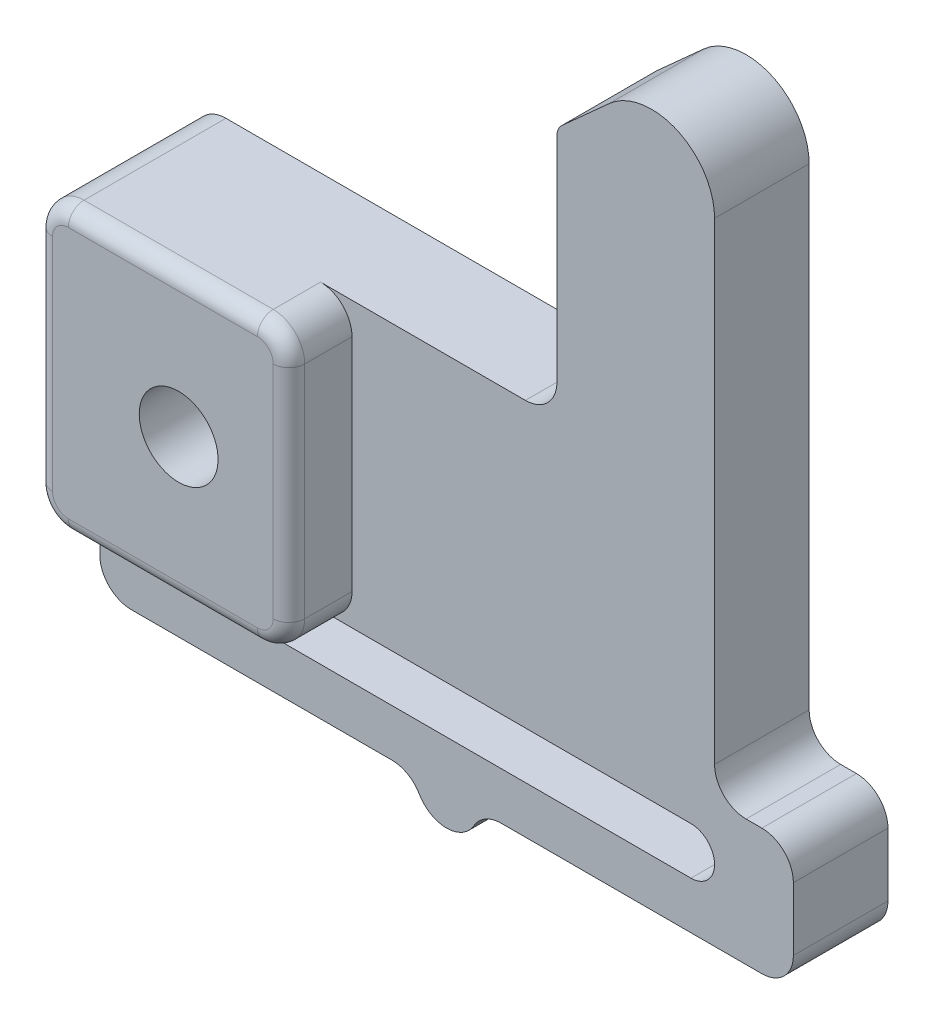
ISO-10303-21;
HEADER;
FILE_DESCRIPTION(('STEP AP214'),'2;1');
FILE_NAME('part.step','',(''),(''),'','','');
FILE_SCHEMA(('AUTOMOTIVE_DESIGN { 1 0 10303 214 1 1 1 1 }'));
ENDSEC;
DATA;
#1=APPLICATION_CONTEXT('core data for automotive mechanical design processes');
#2=APPLICATION_PROTOCOL_DEFINITION('international standard','automotive_design',2000,#1);
#3=PRODUCT_CONTEXT('',#1,'mechanical');
#4=PRODUCT('Part','Part','',(#3));
#5=PRODUCT_RELATED_PRODUCT_CATEGORY('part','',(#4));
#6=PRODUCT_DEFINITION_FORMATION('','',#4);
#7=PRODUCT_DEFINITION_CONTEXT('part definition',#1,'design');
#8=PRODUCT_DEFINITION('design','',#6,#7);
#9=PRODUCT_DEFINITION_SHAPE('','',#8);
#10=(LENGTH_UNIT() NAMED_UNIT(*) SI_UNIT(.MILLI.,.METRE.));
#11=(NAMED_UNIT(*) PLANE_ANGLE_UNIT() SI_UNIT($,.RADIAN.));
#12=(NAMED_UNIT(*) SI_UNIT($,.STERADIAN.) SOLID_ANGLE_UNIT());
#13=UNCERTAINTY_MEASURE_WITH_UNIT(LENGTH_MEASURE(1.E-05),#10,'distance_accuracy_value','');
#14=(GEOMETRIC_REPRESENTATION_CONTEXT(3) GLOBAL_UNCERTAINTY_ASSIGNED_CONTEXT((#13)) GLOBAL_UNIT_ASSIGNED_CONTEXT((#10,
#11,#12)) REPRESENTATION_CONTEXT('',''));
#15=CARTESIAN_POINT('',(0.,0.,0.));
#16=DIRECTION('',(0.,0.,1.));
#17=DIRECTION('',(1.,0.,0.));
#18=AXIS2_PLACEMENT_3D('',#15,#16,#17);
#19=CARTESIAN_POINT('',(19.5,0.,3.));
#20=DIRECTION('',(0.,1.,0.));
#21=DIRECTION('',(0.,0.,1.));
#22=AXIS2_PLACEMENT_3D('',#19,#20,#21);
#23=PLANE('',#22);
#24=DIRECTION('',(1.,0.,0.));
#25=VECTOR('',#24,1.);
#26=CARTESIAN_POINT('',(19.5,0.,0.));
#27=LINE('',#26,#25);
#28=CARTESIAN_POINT('',(12.7320508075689,0.,0.));
#29=VERTEX_POINT('',#28);
#30=CARTESIAN_POINT('',(21.,0.,0.));
#31=VERTEX_POINT('',#30);
#32=EDGE_CURVE('E489',#29,#31,#27,.T.);
#33=ORIENTED_EDGE('',*,*,#32,.T.);
#34=DIRECTION('',(0.,0.,-1.));
#35=VECTOR('',#34,1.);
#36=CARTESIAN_POINT('',(21.,0.,3.));
#37=LINE('',#36,#35);
#38=CARTESIAN_POINT('',(21.,0.,3.));
#39=VERTEX_POINT('',#38);
#40=EDGE_CURVE('E367',#39,#31,#37,.T.);
#41=ORIENTED_EDGE('',*,*,#40,.F.);
#42=DIRECTION('',(1.,0.,0.));
#43=VECTOR('',#42,1.);
#44=CARTESIAN_POINT('',(12.7320508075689,0.,3.));
#45=LINE('',#44,#43);
#46=CARTESIAN_POINT('',(12.7320508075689,0.,3.));
#47=VERTEX_POINT('',#46);
#48=EDGE_CURVE('E534',#47,#39,#45,.T.);
#49=ORIENTED_EDGE('',*,*,#48,.F.);
#50=DIRECTION('',(0.,0.,-1.));
#51=VECTOR('',#50,1.);
#52=CARTESIAN_POINT('',(12.7320508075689,0.,3.));
#53=LINE('',#52,#51);
#54=EDGE_CURVE('E421',#47,#29,#53,.T.);
#55=ORIENTED_EDGE('',*,*,#54,.T.);
#56=EDGE_LOOP('',(#33,#41,#49,#55));
#57=FACE_BOUND('',#56,.T.);
#58=ADVANCED_FACE('F34',(#57),#23,.F.);
#59=CARTESIAN_POINT('',(21.,1.,3.));
#60=DIRECTION('',(0.,0.,-1.));
#61=DIRECTION('',(-1.,0.,0.));
#62=AXIS2_PLACEMENT_3D('',#59,#60,#61);
#63=CYLINDRICAL_SURFACE('',#62,1.);
#64=CARTESIAN_POINT('',(21.,1.,0.));
#65=DIRECTION('',(0.,0.,1.));
#66=DIRECTION('',(1.,0.,0.));
#67=AXIS2_PLACEMENT_3D('',#64,#65,#66);
#68=CIRCLE('',#67,1.);
#69=CARTESIAN_POINT('',(22.,1.00000000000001,0.));
#70=VERTEX_POINT('',#69);
#71=EDGE_CURVE('E482',#31,#70,#68,.T.);
#72=ORIENTED_EDGE('',*,*,#71,.T.);
#73=DIRECTION('',(0.,0.,-1.));
#74=VECTOR('',#73,1.);
#75=CARTESIAN_POINT('',(22.,1.00000000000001,3.));
#76=LINE('',#75,#74);
#77=CARTESIAN_POINT('',(22.,1.00000000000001,3.));
#78=VERTEX_POINT('',#77);
#79=EDGE_CURVE('E473',#78,#70,#76,.T.);
#80=ORIENTED_EDGE('',*,*,#79,.F.);
#81=CARTESIAN_POINT('',(21.,1.,3.));
#82=DIRECTION('',(0.,0.,1.));
#83=DIRECTION('',(1.,0.,0.));
#84=AXIS2_PLACEMENT_3D('',#81,#82,#83);
#85=CIRCLE('',#84,1.);
#86=EDGE_CURVE('E483',#39,#78,#85,.T.);
#87=ORIENTED_EDGE('',*,*,#86,.F.);
#88=ORIENTED_EDGE('',*,*,#40,.T.);
#89=EDGE_LOOP('',(#72,#80,#87,#88));
#90=FACE_BOUND('',#89,.T.);
#91=ADVANCED_FACE('F480',(#90),#63,.T.);
#92=CARTESIAN_POINT('',(22.,1.00000000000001,3.));
#93=DIRECTION('',(-1.,0.,0.));
#94=DIRECTION('',(0.,0.,1.));
#95=AXIS2_PLACEMENT_3D('',#92,#93,#94);
#96=PLANE('',#95);
#97=DIRECTION('',(0.,1.,0.));
#98=VECTOR('',#97,1.);
#99=CARTESIAN_POINT('',(22.,1.00000000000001,0.));
#100=LINE('',#99,#98);
#101=CARTESIAN_POINT('',(22.,2.99999999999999,0.));
#102=VERTEX_POINT('',#101);
#103=EDGE_CURVE('E492',#70,#102,#100,.T.);
#104=ORIENTED_EDGE('',*,*,#103,.T.);
#105=DIRECTION('',(0.,0.,-1.));
#106=VECTOR('',#105,1.);
#107=CARTESIAN_POINT('',(22.,2.99999999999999,3.));
#108=LINE('',#107,#106);
#109=CARTESIAN_POINT('',(22.,2.99999999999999,3.));
#110=VERTEX_POINT('',#109);
#111=EDGE_CURVE('E470',#110,#102,#108,.T.);
#112=ORIENTED_EDGE('',*,*,#111,.F.);
#113=DIRECTION('',(0.,1.,0.));
#114=VECTOR('',#113,1.);
#115=CARTESIAN_POINT('',(22.,1.00000000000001,3.));
#116=LINE('',#115,#114);
#117=EDGE_CURVE('E537',#78,#110,#116,.T.);
#118=ORIENTED_EDGE('',*,*,#117,.F.);
#119=ORIENTED_EDGE('',*,*,#79,.T.);
#120=EDGE_LOOP('',(#104,#112,#118,#119));
#121=FACE_BOUND('',#120,.T.);
#122=ADVANCED_FACE('F664',(#121),#96,.F.);
#123=CARTESIAN_POINT('',(21.,3.,3.));
#124=DIRECTION('',(0.,0.,-1.));
#125=DIRECTION('',(-1.,0.,0.));
#126=AXIS2_PLACEMENT_3D('',#123,#124,#125);
#127=CYLINDRICAL_SURFACE('',#126,1.);
#128=CARTESIAN_POINT('',(21.,3.,0.));
#129=DIRECTION('',(0.,0.,1.));
#130=DIRECTION('',(1.,0.,0.));
#131=AXIS2_PLACEMENT_3D('',#128,#129,#130);
#132=CIRCLE('',#131,1.);
#133=CARTESIAN_POINT('',(21.,4.,0.));
#134=VERTEX_POINT('',#133);
#135=EDGE_CURVE('E494',#102,#134,#132,.T.);
#136=ORIENTED_EDGE('',*,*,#135,.T.);
#137=DIRECTION('',(0.,0.,-1.));
#138=VECTOR('',#137,1.);
#139=CARTESIAN_POINT('',(21.,4.,3.));
#140=LINE('',#139,#138);
#141=CARTESIAN_POINT('',(21.,4.,3.));
#142=VERTEX_POINT('',#141);
#143=EDGE_CURVE('E467',#142,#134,#140,.T.);
#144=ORIENTED_EDGE('',*,*,#143,.F.);
#145=CARTESIAN_POINT('',(21.,3.,3.));
#146=DIRECTION('',(0.,0.,1.));
#147=DIRECTION('',(1.,0.,0.));
#148=AXIS2_PLACEMENT_3D('',#145,#146,#147);
#149=CIRCLE('',#148,1.);
#150=EDGE_CURVE('E539',#110,#142,#149,.T.);
#151=ORIENTED_EDGE('',*,*,#150,.F.);
#152=ORIENTED_EDGE('',*,*,#111,.T.);
#153=EDGE_LOOP('',(#136,#144,#151,#152));
#154=FACE_BOUND('',#153,.T.);
#155=ADVANCED_FACE('F735',(#154),#127,.T.);
#156=CARTESIAN_POINT('',(21.,4.,3.));
#157=DIRECTION('',(0.,-1.,0.));
#158=DIRECTION('',(0.,0.,-1.));
#159=AXIS2_PLACEMENT_3D('',#156,#157,#158);
#160=PLANE('',#159);
#161=DIRECTION('',(-1.,0.,0.));
#162=VECTOR('',#161,1.);
#163=CARTESIAN_POINT('',(21.,4.,0.));
#164=LINE('',#163,#162);
#165=CARTESIAN_POINT('',(20.5,4.,0.));
#166=VERTEX_POINT('',#165);
#167=EDGE_CURVE('E500',#134,#166,#164,.T.);
#168=ORIENTED_EDGE('',*,*,#167,.T.);
#169=DIRECTION('',(0.,0.,-1.));
#170=VECTOR('',#169,1.);
#171=CARTESIAN_POINT('',(20.5,4.,3.));
#172=LINE('',#171,#170);
#173=CARTESIAN_POINT('',(20.5,4.,3.));
#174=VERTEX_POINT('',#173);
#175=EDGE_CURVE('E464',#174,#166,#172,.T.);
#176=ORIENTED_EDGE('',*,*,#175,.F.);
#177=DIRECTION('',(-1.,0.,0.));
#178=VECTOR('',#177,1.);
#179=CARTESIAN_POINT('',(21.,4.,3.));
#180=LINE('',#179,#178);
#181=EDGE_CURVE('E541',#142,#174,#180,.T.);
#182=ORIENTED_EDGE('',*,*,#181,.F.);
#183=ORIENTED_EDGE('',*,*,#143,.T.);
#184=EDGE_LOOP('',(#168,#176,#182,#183));
#185=FACE_BOUND('',#184,.T.);
#186=ADVANCED_FACE('F732',(#185),#160,.F.);
#187=CARTESIAN_POINT('',(20.5,5.,3.));
#188=DIRECTION('',(0.,0.,-1.));
#189=DIRECTION('',(-1.,0.,0.));
#190=AXIS2_PLACEMENT_3D('',#187,#188,#189);
#191=CYLINDRICAL_SURFACE('',#190,1.);
#192=CARTESIAN_POINT('',(20.5,5.,0.));
#193=DIRECTION('',(0.,0.,-1.));
#194=DIRECTION('',(-1.,0.,0.));
#195=AXIS2_PLACEMENT_3D('',#192,#193,#194);
#196=CIRCLE('',#195,1.);
#197=CARTESIAN_POINT('',(19.5,5.00000000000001,0.));
#198=VERTEX_POINT('',#197);
#199=EDGE_CURVE('E502',#166,#198,#196,.T.);
#200=ORIENTED_EDGE('',*,*,#199,.T.);
#201=DIRECTION('',(0.,0.,-1.));
#202=VECTOR('',#201,1.);
#203=CARTESIAN_POINT('',(19.5,5.00000000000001,3.));
#204=LINE('',#203,#202);
#205=CARTESIAN_POINT('',(19.5,5.00000000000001,3.));
#206=VERTEX_POINT('',#205);
#207=EDGE_CURVE('E461',#206,#198,#204,.T.);
#208=ORIENTED_EDGE('',*,*,#207,.F.);
#209=CARTESIAN_POINT('',(20.5,5.,3.));
#210=DIRECTION('',(0.,0.,-1.));
#211=DIRECTION('',(-1.,0.,0.));
#212=AXIS2_PLACEMENT_3D('',#209,#210,#211);
#213=CIRCLE('',#212,1.);
#214=EDGE_CURVE('E543',#174,#206,#213,.T.);
#215=ORIENTED_EDGE('',*,*,#214,.F.);
#216=ORIENTED_EDGE('',*,*,#175,.T.);
#217=EDGE_LOOP('',(#200,#208,#215,#216));
#218=FACE_BOUND('',#217,.T.);
#219=ADVANCED_FACE('F728',(#218),#191,.F.);
#220=CARTESIAN_POINT('',(19.5,5.00000000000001,3.));
#221=DIRECTION('',(-1.,0.,0.));
#222=DIRECTION('',(0.,0.,1.));
#223=AXIS2_PLACEMENT_3D('',#220,#221,#222);
#224=PLANE('',#223);
#225=DIRECTION('',(0.,1.,0.));
#226=VECTOR('',#225,1.);
#227=CARTESIAN_POINT('',(19.5,5.00000000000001,0.));
#228=LINE('',#227,#226);
#229=CARTESIAN_POINT('',(19.5,20.,0.));
#230=VERTEX_POINT('',#229);
#231=EDGE_CURVE('E504',#198,#230,#228,.T.);
#232=ORIENTED_EDGE('',*,*,#231,.T.);
#233=DIRECTION('',(0.,0.,-1.));
#234=VECTOR('',#233,1.);
#235=CARTESIAN_POINT('',(19.5,20.,3.));
#236=LINE('',#235,#234);
#237=CARTESIAN_POINT('',(19.5,20.,3.));
#238=VERTEX_POINT('',#237);
#239=EDGE_CURVE('E458',#238,#230,#236,.T.);
#240=ORIENTED_EDGE('',*,*,#239,.F.);
#241=DIRECTION('',(0.,1.,0.));
#242=VECTOR('',#241,1.);
#243=CARTESIAN_POINT('',(19.5,5.00000000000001,3.));
#244=LINE('',#243,#242);
#245=EDGE_CURVE('E545',#206,#238,#244,.T.);
#246=ORIENTED_EDGE('',*,*,#245,.F.);
#247=ORIENTED_EDGE('',*,*,#207,.T.);
#248=EDGE_LOOP('',(#232,#240,#246,#247));
#249=FACE_BOUND('',#248,.T.);
#250=ADVANCED_FACE('F723',(#249),#224,.F.);
#251=CARTESIAN_POINT('',(17.5,20.,3.));
#252=DIRECTION('',(0.,0.,-1.));
#253=DIRECTION('',(-1.,0.,0.));
#254=AXIS2_PLACEMENT_3D('',#251,#252,#253);
#255=CYLINDRICAL_SURFACE('',#254,2.);
#256=CARTESIAN_POINT('',(17.5,20.,0.));
#257=DIRECTION('',(0.,0.,1.));
#258=DIRECTION('',(1.,0.,0.));
#259=AXIS2_PLACEMENT_3D('',#256,#257,#258);
#260=CIRCLE('',#259,2.);
#261=CARTESIAN_POINT('',(16.1617387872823,21.4862896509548,0.));
#262=VERTEX_POINT('',#261);
#263=EDGE_CURVE('E506',#230,#262,#260,.T.);
#264=ORIENTED_EDGE('',*,*,#263,.T.);
#265=DIRECTION('',(0.,0.,-1.));
#266=VECTOR('',#265,1.);
#267=CARTESIAN_POINT('',(16.1617387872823,21.4862896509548,3.));
#268=LINE('',#267,#266);
#269=CARTESIAN_POINT('',(16.1617387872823,21.4862896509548,3.));
#270=VERTEX_POINT('',#269);
#271=EDGE_CURVE('E455',#270,#262,#268,.T.);
#272=ORIENTED_EDGE('',*,*,#271,.F.);
#273=CARTESIAN_POINT('',(17.5,20.,3.));
#274=DIRECTION('',(0.,0.,1.));
#275=DIRECTION('',(1.,0.,0.));
#276=AXIS2_PLACEMENT_3D('',#273,#274,#275);
#277=CIRCLE('',#276,2.);
#278=EDGE_CURVE('E547',#238,#270,#277,.T.);
#279=ORIENTED_EDGE('',*,*,#278,.F.);
#280=ORIENTED_EDGE('',*,*,#239,.T.);
#281=EDGE_LOOP('',(#264,#272,#279,#280));
#282=FACE_BOUND('',#281,.T.);
#283=ADVANCED_FACE('F717',(#282),#255,.T.);
#284=CARTESIAN_POINT('',(16.1617387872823,21.4862896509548,3.));
#285=DIRECTION('',(0.669130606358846,-0.743144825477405,0.));
#286=DIRECTION('',(0.743144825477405,0.669130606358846,0.));
#287=AXIS2_PLACEMENT_3D('',#284,#285,#286);
#288=PLANE('',#287);
#289=DIRECTION('',(-0.743144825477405,-0.669130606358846,0.));
#290=VECTOR('',#289,1.);
#291=CARTESIAN_POINT('',(16.1617387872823,21.4862896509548,0.));
#292=LINE('',#291,#290);
#293=CARTESIAN_POINT('',(14.6654346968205,20.1390113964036,0.));
#294=VERTEX_POINT('',#293);
#295=EDGE_CURVE('E508',#262,#294,#292,.T.);
#296=ORIENTED_EDGE('',*,*,#295,.T.);
#297=DIRECTION('',(0.,0.,-1.));
#298=VECTOR('',#297,1.);
#299=CARTESIAN_POINT('',(14.6654346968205,20.1390113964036,3.));
#300=LINE('',#299,#298);
#301=CARTESIAN_POINT('',(14.6654346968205,20.1390113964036,3.));
#302=VERTEX_POINT('',#301);
#303=EDGE_CURVE('E452',#302,#294,#300,.T.);
#304=ORIENTED_EDGE('',*,*,#303,.F.);
#305=DIRECTION('',(-0.743144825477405,-0.669130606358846,0.));
#306=VECTOR('',#305,1.);
#307=CARTESIAN_POINT('',(16.1617387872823,21.4862896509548,3.));
#308=LINE('',#307,#306);
#309=EDGE_CURVE('E549',#270,#302,#308,.T.);
#310=ORIENTED_EDGE('',*,*,#309,.F.);
#311=ORIENTED_EDGE('',*,*,#271,.T.);
#312=EDGE_LOOP('',(#296,#304,#310,#311));
#313=FACE_BOUND('',#312,.T.);
#314=ADVANCED_FACE('F713',(#313),#288,.F.);
#315=CARTESIAN_POINT('',(15.,19.767438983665,3.));
#316=DIRECTION('',(0.,0.,-1.));
#317=DIRECTION('',(-1.,0.,0.));
#318=AXIS2_PLACEMENT_3D('',#315,#316,#317);
#319=CYLINDRICAL_SURFACE('',#318,0.500000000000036);
#320=CARTESIAN_POINT('',(15.,19.767438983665,0.));
#321=DIRECTION('',(0.,0.,1.));
#322=DIRECTION('',(1.,0.,0.));
#323=AXIS2_PLACEMENT_3D('',#320,#321,#322);
#324=CIRCLE('',#323,0.500000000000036);
#325=CARTESIAN_POINT('',(14.5,19.767438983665,0.));
#326=VERTEX_POINT('',#325);
#327=EDGE_CURVE('E510',#294,#326,#324,.T.);
#328=ORIENTED_EDGE('',*,*,#327,.T.);
#329=DIRECTION('',(0.,0.,-1.));
#330=VECTOR('',#329,1.);
#331=CARTESIAN_POINT('',(14.5,19.767438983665,3.));
#332=LINE('',#331,#330);
#333=CARTESIAN_POINT('',(14.5,19.767438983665,3.));
#334=VERTEX_POINT('',#333);
#335=EDGE_CURVE('E449',#334,#326,#332,.T.);
#336=ORIENTED_EDGE('',*,*,#335,.F.);
#337=CARTESIAN_POINT('',(15.,19.767438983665,3.));
#338=DIRECTION('',(0.,0.,1.));
#339=DIRECTION('',(1.,0.,0.));
#340=AXIS2_PLACEMENT_3D('',#337,#338,#339);
#341=CIRCLE('',#340,0.500000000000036);
#342=EDGE_CURVE('E551',#302,#334,#341,.T.);
#343=ORIENTED_EDGE('',*,*,#342,.F.);
#344=ORIENTED_EDGE('',*,*,#303,.T.);
#345=EDGE_LOOP('',(#328,#336,#343,#344));
#346=FACE_BOUND('',#345,.T.);
#347=ADVANCED_FACE('F708',(#346),#319,.T.);
#348=CARTESIAN_POINT('',(14.5,19.767438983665,3.));
#349=DIRECTION('',(1.,0.,0.));
#350=DIRECTION('',(0.,1.,0.));
#351=AXIS2_PLACEMENT_3D('',#348,#349,#350);
#352=PLANE('',#351);
#353=DIRECTION('',(0.,-1.,0.));
#354=VECTOR('',#353,1.);
#355=CARTESIAN_POINT('',(14.5,19.767438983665,0.));
#356=LINE('',#355,#354);
#357=CARTESIAN_POINT('',(14.4999999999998,13.,0.));
#358=VERTEX_POINT('',#357);
#359=EDGE_CURVE('E512',#326,#358,#356,.T.);
#360=ORIENTED_EDGE('',*,*,#359,.T.);
#361=DIRECTION('',(0.,0.,-1.));
#362=VECTOR('',#361,1.);
#363=CARTESIAN_POINT('',(14.4999999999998,13.,3.));
#364=LINE('',#363,#362);
#365=CARTESIAN_POINT('',(14.4999999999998,13.,3.));
#366=VERTEX_POINT('',#365);
#367=EDGE_CURVE('E446',#366,#358,#364,.T.);
#368=ORIENTED_EDGE('',*,*,#367,.F.);
#369=DIRECTION('',(0.,-1.,0.));
#370=VECTOR('',#369,1.);
#371=CARTESIAN_POINT('',(14.5,19.767438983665,3.));
#372=LINE('',#371,#370);
#373=EDGE_CURVE('E553',#334,#366,#372,.T.);
#374=ORIENTED_EDGE('',*,*,#373,.F.);
#375=ORIENTED_EDGE('',*,*,#335,.T.);
#376=EDGE_LOOP('',(#360,#368,#374,#375));
#377=FACE_BOUND('',#376,.T.);
#378=ADVANCED_FACE('F702',(#377),#352,.F.);
#379=CARTESIAN_POINT('',(13.4999999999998,13.,3.));
#380=DIRECTION('',(0.,0.,-1.));
#381=DIRECTION('',(-1.,0.,0.));
#382=AXIS2_PLACEMENT_3D('',#379,#380,#381);
#383=CYLINDRICAL_SURFACE('',#382,0.999999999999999);
#384=CARTESIAN_POINT('',(13.4999999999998,13.,0.));
#385=DIRECTION('',(0.,0.,-1.));
#386=DIRECTION('',(-1.,0.,0.));
#387=AXIS2_PLACEMENT_3D('',#384,#385,#386);
#388=CIRCLE('',#387,0.999999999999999);
#389=CARTESIAN_POINT('',(13.4999999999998,12.,0.));
#390=VERTEX_POINT('',#389);
#391=EDGE_CURVE('E514',#358,#390,#388,.T.);
#392=ORIENTED_EDGE('',*,*,#391,.T.);
#393=DIRECTION('',(0.,0.,-1.));
#394=VECTOR('',#393,1.);
#395=CARTESIAN_POINT('',(13.4999999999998,12.,3.));
#396=LINE('',#395,#394);
#397=CARTESIAN_POINT('',(13.4999999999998,12.,3.));
#398=VERTEX_POINT('',#397);
#399=EDGE_CURVE('E443',#398,#390,#396,.T.);
#400=ORIENTED_EDGE('',*,*,#399,.F.);
#401=CARTESIAN_POINT('',(13.4999999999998,13.,3.));
#402=DIRECTION('',(0.,0.,-1.));
#403=DIRECTION('',(-1.,0.,0.));
#404=AXIS2_PLACEMENT_3D('',#401,#402,#403);
#405=CIRCLE('',#404,0.999999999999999);
#406=EDGE_CURVE('E554',#366,#398,#405,.T.);
#407=ORIENTED_EDGE('',*,*,#406,.F.);
#408=ORIENTED_EDGE('',*,*,#367,.T.);
#409=EDGE_LOOP('',(#392,#400,#407,#408));
#410=FACE_BOUND('',#409,.T.);
#411=ADVANCED_FACE('F698',(#410),#383,.F.);
#412=CARTESIAN_POINT('',(13.4999999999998,12.,3.));
#413=DIRECTION('',(0.,-1.,0.));
#414=DIRECTION('',(1.,0.,0.));
#415=AXIS2_PLACEMENT_3D('',#412,#413,#414);
#416=PLANE('',#415);
#417=DIRECTION('',(0.,0.,-1.));
#418=VECTOR('',#417,1.);
#419=CARTESIAN_POINT('',(1.00000000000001,12.,3.));
#420=LINE('',#419,#418);
#421=CARTESIAN_POINT('',(1.00000000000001,12.,4.5));
#422=VERTEX_POINT('',#421);
#423=CARTESIAN_POINT('',(1.00000000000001,12.,0.));
#424=VERTEX_POINT('',#423);
#425=EDGE_CURVE('E441',#422,#424,#420,.T.);
#426=ORIENTED_EDGE('',*,*,#425,.F.);
#427=DIRECTION('',(-1.,0.,0.));
#428=VECTOR('',#427,1.);
#429=CARTESIAN_POINT('',(13.4999999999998,12.,4.5));
#430=LINE('',#429,#428);
#431=CARTESIAN_POINT('',(6.99999999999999,12.,4.5));
#432=VERTEX_POINT('',#431);
#433=EDGE_CURVE('E41',#422,#432,#430,.F.);
#434=ORIENTED_EDGE('',*,*,#433,.T.);
#435=DIRECTION('',(0.,0.,-1.));
#436=VECTOR('',#435,1.);
#437=CARTESIAN_POINT('',(6.99999999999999,12.,5.));
#438=LINE('',#437,#436);
#439=CARTESIAN_POINT('',(7.,12.,3.));
#440=VERTEX_POINT('',#439);
#441=EDGE_CURVE('E392',#432,#440,#438,.T.);
#442=ORIENTED_EDGE('',*,*,#441,.T.);
#443=DIRECTION('',(-1.,0.,0.));
#444=VECTOR('',#443,1.);
#445=CARTESIAN_POINT('',(13.4999999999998,12.,3.));
#446=LINE('',#445,#444);
#447=EDGE_CURVE('E405',#398,#440,#446,.T.);
#448=ORIENTED_EDGE('',*,*,#447,.F.);
#449=ORIENTED_EDGE('',*,*,#399,.T.);
#450=DIRECTION('',(-1.,0.,0.));
#451=VECTOR('',#450,1.);
#452=CARTESIAN_POINT('',(13.4999999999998,12.,0.));
#453=LINE('',#452,#451);
#454=EDGE_CURVE('E516',#390,#424,#453,.T.);
#455=ORIENTED_EDGE('',*,*,#454,.T.);
#456=EDGE_LOOP('',(#426,#434,#442,#448,#449,#455));
#457=FACE_BOUND('',#456,.T.);
#458=ADVANCED_FACE('F695',(#457),#416,.F.);
#459=CARTESIAN_POINT('',(1.,11.,3.));
#460=DIRECTION('',(0.,0.,-1.));
#461=DIRECTION('',(-1.,0.,0.));
#462=AXIS2_PLACEMENT_3D('',#459,#460,#461);
#463=CYLINDRICAL_SURFACE('',#462,1.);
#464=DIRECTION('',(0.,0.,-1.));
#465=VECTOR('',#464,1.);
#466=CARTESIAN_POINT('',(0.,11.,3.));
#467=LINE('',#466,#465);
#468=CARTESIAN_POINT('',(0.,11.,4.5));
#469=VERTEX_POINT('',#468);
#470=CARTESIAN_POINT('',(0.,11.,0.));
#471=VERTEX_POINT('',#470);
#472=EDGE_CURVE('E439',#469,#471,#467,.T.);
#473=ORIENTED_EDGE('',*,*,#472,.F.);
#474=CARTESIAN_POINT('',(1.,11.,4.5));
#475=DIRECTION('',(0.,0.,-1.));
#476=DIRECTION('',(-1.,0.,0.));
#477=AXIS2_PLACEMENT_3D('',#474,#475,#476);
#478=CIRCLE('',#477,1.);
#479=EDGE_CURVE('E55',#469,#422,#478,.T.);
#480=ORIENTED_EDGE('',*,*,#479,.T.);
#481=ORIENTED_EDGE('',*,*,#425,.T.);
#482=CARTESIAN_POINT('',(1.,11.,0.));
#483=DIRECTION('',(0.,0.,1.));
#484=DIRECTION('',(1.,0.,0.));
#485=AXIS2_PLACEMENT_3D('',#482,#483,#484);
#486=CIRCLE('',#485,1.);
#487=EDGE_CURVE('E519',#424,#471,#486,.T.);
#488=ORIENTED_EDGE('',*,*,#487,.T.);
#489=EDGE_LOOP('',(#473,#480,#481,#488));
#490=FACE_BOUND('',#489,.T.);
#491=ADVANCED_FACE('F691',(#490),#463,.T.);
#492=CARTESIAN_POINT('',(0.,11.,3.));
#493=DIRECTION('',(1.,0.,0.));
#494=DIRECTION('',(0.,1.,0.));
#495=AXIS2_PLACEMENT_3D('',#492,#493,#494);
#496=PLANE('',#495);
#497=DIRECTION('',(0.,0.,-1.));
#498=VECTOR('',#497,1.);
#499=CARTESIAN_POINT('',(0.,4.00000000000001,5.));
#500=LINE('',#499,#498);
#501=CARTESIAN_POINT('',(0.,4.00000000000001,4.5));
#502=VERTEX_POINT('',#501);
#503=CARTESIAN_POINT('',(0.,4.,3.));
#504=VERTEX_POINT('',#503);
#505=EDGE_CURVE('E390',#502,#504,#500,.T.);
#506=ORIENTED_EDGE('',*,*,#505,.F.);
#507=DIRECTION('',(0.,-1.,0.));
#508=VECTOR('',#507,1.);
#509=CARTESIAN_POINT('',(0.,11.,4.5));
#510=LINE('',#509,#508);
#511=EDGE_CURVE('E598',#502,#469,#510,.F.);
#512=ORIENTED_EDGE('',*,*,#511,.T.);
#513=ORIENTED_EDGE('',*,*,#472,.T.);
#514=DIRECTION('',(0.,-1.,0.));
#515=VECTOR('',#514,1.);
#516=CARTESIAN_POINT('',(0.,11.,0.));
#517=LINE('',#516,#515);
#518=CARTESIAN_POINT('',(0.,1.00000000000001,0.));
#519=VERTEX_POINT('',#518);
#520=EDGE_CURVE('E522',#471,#519,#517,.T.);
#521=ORIENTED_EDGE('',*,*,#520,.T.);
#522=DIRECTION('',(0.,0.,-1.));
#523=VECTOR('',#522,1.);
#524=CARTESIAN_POINT('',(0.,1.00000000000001,3.));
#525=LINE('',#524,#523);
#526=CARTESIAN_POINT('',(0.,1.00000000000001,3.));
#527=VERTEX_POINT('',#526);
#528=EDGE_CURVE('E436',#527,#519,#525,.T.);
#529=ORIENTED_EDGE('',*,*,#528,.F.);
#530=DIRECTION('',(0.,-1.,0.));
#531=VECTOR('',#530,1.);
#532=CARTESIAN_POINT('',(0.,11.,3.));
#533=LINE('',#532,#531);
#534=EDGE_CURVE('E401',#504,#527,#533,.T.);
#535=ORIENTED_EDGE('',*,*,#534,.F.);
#536=EDGE_LOOP('',(#506,#512,#513,#521,#529,#535));
#537=FACE_BOUND('',#536,.T.);
#538=ADVANCED_FACE('F597',(#537),#496,.F.);
#539=CARTESIAN_POINT('',(1.,1.,3.));
#540=DIRECTION('',(0.,0.,-1.));
#541=DIRECTION('',(-1.,0.,0.));
#542=AXIS2_PLACEMENT_3D('',#539,#540,#541);
#543=CYLINDRICAL_SURFACE('',#542,1.);
#544=CARTESIAN_POINT('',(1.,1.,0.));
#545=DIRECTION('',(0.,0.,1.));
#546=DIRECTION('',(-1.,0.,0.));
#547=AXIS2_PLACEMENT_3D('',#544,#545,#546);
#548=CIRCLE('',#547,1.);
#549=CARTESIAN_POINT('',(1.00000000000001,0.,0.));
#550=VERTEX_POINT('',#549);
#551=EDGE_CURVE('E524',#519,#550,#548,.T.);
#552=ORIENTED_EDGE('',*,*,#551,.T.);
#553=DIRECTION('',(0.,0.,-1.));
#554=VECTOR('',#553,1.);
#555=CARTESIAN_POINT('',(1.00000000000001,0.,3.));
#556=LINE('',#555,#554);
#557=CARTESIAN_POINT('',(1.00000000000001,0.,3.));
#558=VERTEX_POINT('',#557);
#559=EDGE_CURVE('E433',#558,#550,#556,.T.);
#560=ORIENTED_EDGE('',*,*,#559,.F.);
#561=CARTESIAN_POINT('',(1.,1.,3.));
#562=DIRECTION('',(0.,0.,1.));
#563=DIRECTION('',(-1.,0.,0.));
#564=AXIS2_PLACEMENT_3D('',#561,#562,#563);
#565=CIRCLE('',#564,1.);
#566=EDGE_CURVE('E404',#527,#558,#565,.T.);
#567=ORIENTED_EDGE('',*,*,#566,.F.);
#568=ORIENTED_EDGE('',*,*,#528,.T.);
#569=EDGE_LOOP('',(#552,#560,#567,#568));
#570=FACE_BOUND('',#569,.T.);
#571=ADVANCED_FACE('F689',(#570),#543,.T.);
#572=CARTESIAN_POINT('',(1.00000000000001,0.,3.));
#573=DIRECTION('',(0.,1.,0.));
#574=DIRECTION('',(0.,0.,1.));
#575=AXIS2_PLACEMENT_3D('',#572,#573,#574);
#576=PLANE('',#575);
#577=DIRECTION('',(1.,0.,0.));
#578=VECTOR('',#577,1.);
#579=CARTESIAN_POINT('',(1.00000000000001,0.,0.));
#580=LINE('',#579,#578);
#581=CARTESIAN_POINT('',(9.26794919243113,0.,0.));
#582=VERTEX_POINT('',#581);
#583=EDGE_CURVE('E526',#550,#582,#580,.T.);
#584=ORIENTED_EDGE('',*,*,#583,.T.);
#585=DIRECTION('',(0.,0.,-1.));
#586=VECTOR('',#585,1.);
#587=CARTESIAN_POINT('',(9.26794919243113,0.,3.));
#588=LINE('',#587,#586);
#589=CARTESIAN_POINT('',(9.26794919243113,0.,3.));
#590=VERTEX_POINT('',#589);
#591=EDGE_CURVE('E430',#590,#582,#588,.T.);
#592=ORIENTED_EDGE('',*,*,#591,.F.);
#593=DIRECTION('',(1.,0.,0.));
#594=VECTOR('',#593,1.);
#595=CARTESIAN_POINT('',(1.00000000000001,0.,3.));
#596=LINE('',#595,#594);
#597=EDGE_CURVE('E413',#558,#590,#596,.T.);
#598=ORIENTED_EDGE('',*,*,#597,.F.);
#599=ORIENTED_EDGE('',*,*,#559,.T.);
#600=EDGE_LOOP('',(#584,#592,#598,#599));
#601=FACE_BOUND('',#600,.T.);
#602=ADVANCED_FACE('F683',(#601),#576,.F.);
#603=CARTESIAN_POINT('',(9.26794919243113,-1.,3.));
#604=DIRECTION('',(0.,0.,-1.));
#605=DIRECTION('',(-1.,0.,0.));
#606=AXIS2_PLACEMENT_3D('',#603,#604,#605);
#607=CYLINDRICAL_SURFACE('',#606,1.);
#608=CARTESIAN_POINT('',(9.26794919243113,-1.,0.));
#609=DIRECTION('',(0.,0.,-1.));
#610=DIRECTION('',(1.,0.,0.));
#611=AXIS2_PLACEMENT_3D('',#608,#609,#610);
#612=CIRCLE('',#611,1.);
#613=CARTESIAN_POINT('',(10.1339745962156,-0.499999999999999,0.));
#614=VERTEX_POINT('',#613);
#615=EDGE_CURVE('E528',#582,#614,#612,.T.);
#616=ORIENTED_EDGE('',*,*,#615,.T.);
#617=DIRECTION('',(0.,0.,-1.));
#618=VECTOR('',#617,1.);
#619=CARTESIAN_POINT('',(10.1339745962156,-0.499999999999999,3.));
#620=LINE('',#619,#618);
#621=CARTESIAN_POINT('',(10.1339745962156,-0.499999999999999,3.));
#622=VERTEX_POINT('',#621);
#623=EDGE_CURVE('E427',#622,#614,#620,.T.);
#624=ORIENTED_EDGE('',*,*,#623,.F.);
#625=CARTESIAN_POINT('',(9.26794919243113,-1.,3.));
#626=DIRECTION('',(0.,0.,-1.));
#627=DIRECTION('',(1.,0.,0.));
#628=AXIS2_PLACEMENT_3D('',#625,#626,#627);
#629=CIRCLE('',#628,1.);
#630=EDGE_CURVE('E415',#590,#622,#629,.T.);
#631=ORIENTED_EDGE('',*,*,#630,.F.);
#632=ORIENTED_EDGE('',*,*,#591,.T.);
#633=EDGE_LOOP('',(#616,#624,#631,#632));
#634=FACE_BOUND('',#633,.T.);
#635=ADVANCED_FACE('F679',(#634),#607,.F.);
#636=CARTESIAN_POINT('',(11.,0.,3.));
#637=DIRECTION('',(0.,0.,-1.));
#638=DIRECTION('',(-1.,0.,0.));
#639=AXIS2_PLACEMENT_3D('',#636,#637,#638);
#640=CYLINDRICAL_SURFACE('',#639,0.999999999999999);
#641=CARTESIAN_POINT('',(11.,0.,0.));
#642=DIRECTION('',(0.,0.,1.));
#643=DIRECTION('',(1.,0.,0.));
#644=AXIS2_PLACEMENT_3D('',#641,#642,#643);
#645=CIRCLE('',#644,0.999999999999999);
#646=CARTESIAN_POINT('',(11.8660254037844,-0.5,0.));
#647=VERTEX_POINT('',#646);
#648=EDGE_CURVE('E530',#614,#647,#645,.T.);
#649=ORIENTED_EDGE('',*,*,#648,.T.);
#650=DIRECTION('',(0.,0.,-1.));
#651=VECTOR('',#650,1.);
#652=CARTESIAN_POINT('',(11.8660254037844,-0.5,3.));
#653=LINE('',#652,#651);
#654=CARTESIAN_POINT('',(11.8660254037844,-0.5,3.));
#655=VERTEX_POINT('',#654);
#656=EDGE_CURVE('E424',#655,#647,#653,.T.);
#657=ORIENTED_EDGE('',*,*,#656,.F.);
#658=CARTESIAN_POINT('',(11.,0.,3.));
#659=DIRECTION('',(0.,0.,1.));
#660=DIRECTION('',(1.,0.,0.));
#661=AXIS2_PLACEMENT_3D('',#658,#659,#660);
#662=CIRCLE('',#661,0.999999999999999);
#663=EDGE_CURVE('E417',#622,#655,#662,.T.);
#664=ORIENTED_EDGE('',*,*,#663,.F.);
#665=ORIENTED_EDGE('',*,*,#623,.T.);
#666=EDGE_LOOP('',(#649,#657,#664,#665));
#667=FACE_BOUND('',#666,.T.);
#668=ADVANCED_FACE('F674',(#667),#640,.T.);
#669=CARTESIAN_POINT('',(12.7320508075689,-1.,3.));
#670=DIRECTION('',(0.,0.,-1.));
#671=DIRECTION('',(-1.,0.,0.));
#672=AXIS2_PLACEMENT_3D('',#669,#670,#671);
#673=CYLINDRICAL_SURFACE('',#672,1.);
#674=CARTESIAN_POINT('',(12.7320508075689,-1.,0.));
#675=DIRECTION('',(0.,0.,-1.));
#676=DIRECTION('',(1.,0.,0.));
#677=AXIS2_PLACEMENT_3D('',#674,#675,#676);
#678=CIRCLE('',#677,1.);
#679=EDGE_CURVE('E532',#647,#29,#678,.T.);
#680=ORIENTED_EDGE('',*,*,#679,.T.);
#681=ORIENTED_EDGE('',*,*,#54,.F.);
#682=CARTESIAN_POINT('',(12.7320508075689,-1.,3.));
#683=DIRECTION('',(0.,0.,-1.));
#684=DIRECTION('',(1.,0.,0.));
#685=AXIS2_PLACEMENT_3D('',#682,#683,#684);
#686=CIRCLE('',#685,1.);
#687=EDGE_CURVE('E419',#655,#47,#686,.T.);
#688=ORIENTED_EDGE('',*,*,#687,.F.);
#689=ORIENTED_EDGE('',*,*,#656,.T.);
#690=EDGE_LOOP('',(#680,#681,#688,#689));
#691=FACE_BOUND('',#690,.T.);
#692=ADVANCED_FACE('F668',(#691),#673,.F.);
#693=CARTESIAN_POINT('',(21.,1.,3.));
#694=DIRECTION('',(0.,0.,1.));
#695=DIRECTION('',(1.,0.,0.));
#696=AXIS2_PLACEMENT_3D('',#693,#694,#695);
#697=PLANE('',#696);
#698=CARTESIAN_POINT('',(3.25,2.25,3.));
#699=DIRECTION('',(0.,0.,1.));
#700=DIRECTION('',(1.,0.,0.));
#701=AXIS2_PLACEMENT_3D('',#698,#699,#700);
#702=CIRCLE('',#701,0.749999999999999);
#703=CARTESIAN_POINT('',(3.25,3.,3.));
#704=VERTEX_POINT('',#703);
#705=CARTESIAN_POINT('',(3.24999999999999,1.5,3.));
#706=VERTEX_POINT('',#705);
#707=EDGE_CURVE('E318',#704,#706,#702,.T.);
#708=ORIENTED_EDGE('',*,*,#707,.F.);
#709=DIRECTION('',(1.,0.,0.));
#710=VECTOR('',#709,1.);
#711=CARTESIAN_POINT('',(6.99999999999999,3.,3.));
#712=LINE('',#711,#710);
#713=CARTESIAN_POINT('',(1.00000000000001,3.,3.));
#714=VERTEX_POINT('',#713);
#715=EDGE_CURVE('E355',#714,#704,#712,.T.);
#716=ORIENTED_EDGE('',*,*,#715,.F.);
#717=CARTESIAN_POINT('',(1.,4.,3.));
#718=DIRECTION('',(0.,0.,1.));
#719=DIRECTION('',(-1.,0.,0.));
#720=AXIS2_PLACEMENT_3D('',#717,#718,#719);
#721=CIRCLE('',#720,1.);
#722=EDGE_CURVE('E361',#504,#714,#721,.T.);
#723=ORIENTED_EDGE('',*,*,#722,.F.);
#724=ORIENTED_EDGE('',*,*,#534,.T.);
#725=ORIENTED_EDGE('',*,*,#566,.T.);
#726=ORIENTED_EDGE('',*,*,#597,.T.);
#727=ORIENTED_EDGE('',*,*,#630,.T.);
#728=ORIENTED_EDGE('',*,*,#663,.T.);
#729=ORIENTED_EDGE('',*,*,#687,.T.);
#730=ORIENTED_EDGE('',*,*,#48,.T.);
#731=ORIENTED_EDGE('',*,*,#86,.T.);
#732=ORIENTED_EDGE('',*,*,#117,.T.);
#733=ORIENTED_EDGE('',*,*,#150,.T.);
#734=ORIENTED_EDGE('',*,*,#181,.T.);
#735=ORIENTED_EDGE('',*,*,#214,.T.);
#736=ORIENTED_EDGE('',*,*,#245,.T.);
#737=ORIENTED_EDGE('',*,*,#278,.T.);
#738=ORIENTED_EDGE('',*,*,#309,.T.);
#739=ORIENTED_EDGE('',*,*,#342,.T.);
#740=ORIENTED_EDGE('',*,*,#373,.T.);
#741=ORIENTED_EDGE('',*,*,#406,.T.);
#742=ORIENTED_EDGE('',*,*,#447,.T.);
#743=CARTESIAN_POINT('',(7.,11.,3.));
#744=DIRECTION('',(0.,0.,1.));
#745=DIRECTION('',(-1.,0.,0.));
#746=AXIS2_PLACEMENT_3D('',#743,#744,#745);
#747=CIRCLE('',#746,1.);
#748=CARTESIAN_POINT('',(8.,11.,3.));
#749=VERTEX_POINT('',#748);
#750=EDGE_CURVE('E347',#749,#440,#747,.T.);
#751=ORIENTED_EDGE('',*,*,#750,.F.);
#752=DIRECTION('',(0.,1.,0.));
#753=VECTOR('',#752,1.);
#754=CARTESIAN_POINT('',(8.,11.,3.));
#755=LINE('',#754,#753);
#756=CARTESIAN_POINT('',(8.,4.00000000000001,3.));
#757=VERTEX_POINT('',#756);
#758=EDGE_CURVE('E574',#757,#749,#755,.T.);
#759=ORIENTED_EDGE('',*,*,#758,.F.);
#760=CARTESIAN_POINT('',(7.,4.,3.));
#761=DIRECTION('',(0.,0.,1.));
#762=DIRECTION('',(-1.,0.,0.));
#763=AXIS2_PLACEMENT_3D('',#760,#761,#762);
#764=CIRCLE('',#763,1.);
#765=CARTESIAN_POINT('',(6.99999999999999,3.,3.));
#766=VERTEX_POINT('',#765);
#767=EDGE_CURVE('E578',#766,#757,#764,.T.);
#768=ORIENTED_EDGE('',*,*,#767,.F.);
#769=DIRECTION('',(-1.,0.,0.));
#770=VECTOR('',#769,1.);
#771=CARTESIAN_POINT('',(3.25,3.,3.));
#772=LINE('',#771,#770);
#773=CARTESIAN_POINT('',(18.75,3.,3.));
#774=VERTEX_POINT('',#773);
#775=EDGE_CURVE('E329',#774,#766,#772,.T.);
#776=ORIENTED_EDGE('',*,*,#775,.F.);
#777=CARTESIAN_POINT('',(18.75,2.25,3.));
#778=DIRECTION('',(0.,0.,1.));
#779=DIRECTION('',(1.,0.,0.));
#780=AXIS2_PLACEMENT_3D('',#777,#778,#779);
#781=CIRCLE('',#780,0.750000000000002);
#782=CARTESIAN_POINT('',(18.75,1.5,3.));
#783=VERTEX_POINT('',#782);
#784=EDGE_CURVE('E326',#783,#774,#781,.T.);
#785=ORIENTED_EDGE('',*,*,#784,.F.);
#786=DIRECTION('',(1.,0.,0.));
#787=VECTOR('',#786,1.);
#788=CARTESIAN_POINT('',(18.75,1.5,3.));
#789=LINE('',#788,#787);
#790=EDGE_CURVE('E323',#706,#783,#789,.T.);
#791=ORIENTED_EDGE('',*,*,#790,.F.);
#792=EDGE_LOOP('',(#708,#716,#723,#724,#725,#726,#727,#728,#729,#730,#731,#732,#733,#734,#735,
#736,#737,#738,#739,#740,#741,#742,#751,#759,#768,#776,#785,#791));
#793=FACE_BOUND('',#792,.T.);
#794=ADVANCED_FACE('F562',(#793),#697,.T.);
#795=CARTESIAN_POINT('',(21.,1.,0.));
#796=DIRECTION('',(0.,0.,1.));
#797=DIRECTION('',(1.,0.,0.));
#798=AXIS2_PLACEMENT_3D('',#795,#796,#797);
#799=PLANE('',#798);
#800=DIRECTION('',(-1.,0.,0.));
#801=VECTOR('',#800,1.);
#802=CARTESIAN_POINT('',(7.,5.,0.));
#803=LINE('',#802,#801);
#804=CARTESIAN_POINT('',(7.,5.,0.));
#805=VERTEX_POINT('',#804);
#806=CARTESIAN_POINT('',(2.,5.,0.));
#807=VERTEX_POINT('',#806);
#808=EDGE_CURVE('E293',#805,#807,#803,.T.);
#809=ORIENTED_EDGE('',*,*,#808,.F.);
#810=DIRECTION('',(0.,-1.,0.));
#811=VECTOR('',#810,1.);
#812=CARTESIAN_POINT('',(7.,10.,0.));
#813=LINE('',#812,#811);
#814=CARTESIAN_POINT('',(7.,10.,0.));
#815=VERTEX_POINT('',#814);
#816=EDGE_CURVE('E297',#815,#805,#813,.T.);
#817=ORIENTED_EDGE('',*,*,#816,.F.);
#818=DIRECTION('',(1.,0.,0.));
#819=VECTOR('',#818,1.);
#820=CARTESIAN_POINT('',(7.,10.,0.));
#821=LINE('',#820,#819);
#822=CARTESIAN_POINT('',(2.,10.,0.));
#823=VERTEX_POINT('',#822);
#824=EDGE_CURVE('E302',#823,#815,#821,.T.);
#825=ORIENTED_EDGE('',*,*,#824,.F.);
#826=DIRECTION('',(0.,1.,0.));
#827=VECTOR('',#826,1.);
#828=CARTESIAN_POINT('',(2.,10.,0.));
#829=LINE('',#828,#827);
#830=EDGE_CURVE('E281',#807,#823,#829,.T.);
#831=ORIENTED_EDGE('',*,*,#830,.F.);
#832=EDGE_LOOP('',(#809,#817,#825,#831));
#833=FACE_BOUND('',#832,.T.);
#834=DIRECTION('',(-1.,0.,0.));
#835=VECTOR('',#834,1.);
#836=CARTESIAN_POINT('',(3.25,3.,0.));
#837=LINE('',#836,#835);
#838=CARTESIAN_POINT('',(18.75,3.,0.));
#839=VERTEX_POINT('',#838);
#840=CARTESIAN_POINT('',(3.25,3.,0.));
#841=VERTEX_POINT('',#840);
#842=EDGE_CURVE('E341',#839,#841,#837,.T.);
#843=ORIENTED_EDGE('',*,*,#842,.T.);
#844=CARTESIAN_POINT('',(3.25,2.25,0.));
#845=DIRECTION('',(0.,0.,1.));
#846=DIRECTION('',(1.,0.,0.));
#847=AXIS2_PLACEMENT_3D('',#844,#845,#846);
#848=CIRCLE('',#847,0.749999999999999);
#849=CARTESIAN_POINT('',(3.24999999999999,1.5,0.));
#850=VERTEX_POINT('',#849);
#851=EDGE_CURVE('E332',#841,#850,#848,.T.);
#852=ORIENTED_EDGE('',*,*,#851,.T.);
#853=DIRECTION('',(1.,0.,0.));
#854=VECTOR('',#853,1.);
#855=CARTESIAN_POINT('',(18.75,1.5,0.));
#856=LINE('',#855,#854);
#857=CARTESIAN_POINT('',(18.75,1.5,0.));
#858=VERTEX_POINT('',#857);
#859=EDGE_CURVE('E335',#850,#858,#856,.T.);
#860=ORIENTED_EDGE('',*,*,#859,.T.);
#861=CARTESIAN_POINT('',(18.75,2.25,0.));
#862=DIRECTION('',(0.,0.,1.));
#863=DIRECTION('',(1.,0.,0.));
#864=AXIS2_PLACEMENT_3D('',#861,#862,#863);
#865=CIRCLE('',#864,0.750000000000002);
#866=EDGE_CURVE('E338',#858,#839,#865,.T.);
#867=ORIENTED_EDGE('',*,*,#866,.T.);
#868=EDGE_LOOP('',(#843,#852,#860,#867));
#869=FACE_BOUND('',#868,.T.);
#870=ORIENTED_EDGE('',*,*,#32,.F.);
#871=ORIENTED_EDGE('',*,*,#679,.F.);
#872=ORIENTED_EDGE('',*,*,#648,.F.);
#873=ORIENTED_EDGE('',*,*,#615,.F.);
#874=ORIENTED_EDGE('',*,*,#583,.F.);
#875=ORIENTED_EDGE('',*,*,#551,.F.);
#876=ORIENTED_EDGE('',*,*,#520,.F.);
#877=ORIENTED_EDGE('',*,*,#487,.F.);
#878=ORIENTED_EDGE('',*,*,#454,.F.);
#879=ORIENTED_EDGE('',*,*,#391,.F.);
#880=ORIENTED_EDGE('',*,*,#359,.F.);
#881=ORIENTED_EDGE('',*,*,#327,.F.);
#882=ORIENTED_EDGE('',*,*,#295,.F.);
#883=ORIENTED_EDGE('',*,*,#263,.F.);
#884=ORIENTED_EDGE('',*,*,#231,.F.);
#885=ORIENTED_EDGE('',*,*,#199,.F.);
#886=ORIENTED_EDGE('',*,*,#167,.F.);
#887=ORIENTED_EDGE('',*,*,#135,.F.);
#888=ORIENTED_EDGE('',*,*,#103,.F.);
#889=ORIENTED_EDGE('',*,*,#71,.F.);
#890=EDGE_LOOP('',(#870,#871,#872,#873,#874,#875,#876,#877,#878,#879,#880,#881,#882,#883,#884,
#885,#886,#887,#888,#889));
#891=FACE_BOUND('',#890,.T.);
#892=ADVANCED_FACE('F299',(#833,#869,#891),#799,.F.);
#893=CARTESIAN_POINT('',(7.,11.,5.));
#894=DIRECTION('',(0.,0.,-1.));
#895=DIRECTION('',(-1.,0.,0.));
#896=AXIS2_PLACEMENT_3D('',#893,#894,#895);
#897=CYLINDRICAL_SURFACE('',#896,1.);
#898=ORIENTED_EDGE('',*,*,#441,.F.);
#899=CARTESIAN_POINT('',(7.,11.,4.5));
#900=DIRECTION('',(0.,0.,-1.));
#901=DIRECTION('',(-1.,0.,0.));
#902=AXIS2_PLACEMENT_3D('',#899,#900,#901);
#903=CIRCLE('',#902,1.);
#904=CARTESIAN_POINT('',(8.,11.,4.5));
#905=VERTEX_POINT('',#904);
#906=EDGE_CURVE('E11',#432,#905,#903,.T.);
#907=ORIENTED_EDGE('',*,*,#906,.T.);
#908=DIRECTION('',(0.,0.,-1.));
#909=VECTOR('',#908,1.);
#910=CARTESIAN_POINT('',(8.,11.,5.));
#911=LINE('',#910,#909);
#912=EDGE_CURVE('E569',#905,#749,#911,.T.);
#913=ORIENTED_EDGE('',*,*,#912,.T.);
#914=ORIENTED_EDGE('',*,*,#750,.T.);
#915=EDGE_LOOP('',(#898,#907,#913,#914));
#916=FACE_BOUND('',#915,.T.);
#917=ADVANCED_FACE('F566',(#916),#897,.T.);
#918=CARTESIAN_POINT('',(1.,4.,5.));
#919=DIRECTION('',(0.,0.,-1.));
#920=DIRECTION('',(-1.,0.,0.));
#921=AXIS2_PLACEMENT_3D('',#918,#919,#920);
#922=CYLINDRICAL_SURFACE('',#921,1.);
#923=DIRECTION('',(0.,0.,-1.));
#924=VECTOR('',#923,1.);
#925=CARTESIAN_POINT('',(1.00000000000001,3.,5.));
#926=LINE('',#925,#924);
#927=CARTESIAN_POINT('',(1.00000000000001,3.,4.5));
#928=VERTEX_POINT('',#927);
#929=EDGE_CURVE('E393',#928,#714,#926,.T.);
#930=ORIENTED_EDGE('',*,*,#929,.F.);
#931=CARTESIAN_POINT('',(1.,4.,4.5));
#932=DIRECTION('',(0.,0.,-1.));
#933=DIRECTION('',(-1.,0.,0.));
#934=AXIS2_PLACEMENT_3D('',#931,#932,#933);
#935=CIRCLE('',#934,1.);
#936=EDGE_CURVE('E389',#928,#502,#935,.T.);
#937=ORIENTED_EDGE('',*,*,#936,.T.);
#938=ORIENTED_EDGE('',*,*,#505,.T.);
#939=ORIENTED_EDGE('',*,*,#722,.T.);
#940=EDGE_LOOP('',(#930,#937,#938,#939));
#941=FACE_BOUND('',#940,.T.);
#942=ADVANCED_FACE('F593',(#941),#922,.T.);
#943=CARTESIAN_POINT('',(6.99999999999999,3.,5.));
#944=DIRECTION('',(0.,1.,0.));
#945=DIRECTION('',(-1.,0.,0.));
#946=AXIS2_PLACEMENT_3D('',#943,#944,#945);
#947=PLANE('',#946);
#948=DIRECTION('',(0.,0.,-1.));
#949=VECTOR('',#948,1.);
#950=CARTESIAN_POINT('',(6.99999999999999,3.,5.));
#951=LINE('',#950,#949);
#952=CARTESIAN_POINT('',(6.99999999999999,3.,4.5));
#953=VERTEX_POINT('',#952);
#954=EDGE_CURVE('E576',#953,#766,#951,.T.);
#955=ORIENTED_EDGE('',*,*,#954,.F.);
#956=DIRECTION('',(1.,0.,0.));
#957=VECTOR('',#956,1.);
#958=CARTESIAN_POINT('',(6.99999999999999,3.,4.5));
#959=LINE('',#958,#957);
#960=EDGE_CURVE('E387',#953,#928,#959,.F.);
#961=ORIENTED_EDGE('',*,*,#960,.T.);
#962=ORIENTED_EDGE('',*,*,#929,.T.);
#963=ORIENTED_EDGE('',*,*,#715,.T.);
#964=DIRECTION('',(0.,0.,1.));
#965=VECTOR('',#964,1.);
#966=CARTESIAN_POINT('',(3.25,3.,0.));
#967=LINE('',#966,#965);
#968=EDGE_CURVE('E345',#841,#704,#967,.T.);
#969=ORIENTED_EDGE('',*,*,#968,.F.);
#970=ORIENTED_EDGE('',*,*,#842,.F.);
#971=DIRECTION('',(0.,0.,1.));
#972=VECTOR('',#971,1.);
#973=CARTESIAN_POINT('',(18.75,3.,0.));
#974=LINE('',#973,#972);
#975=EDGE_CURVE('E348',#839,#774,#974,.T.);
#976=ORIENTED_EDGE('',*,*,#975,.T.);
#977=ORIENTED_EDGE('',*,*,#775,.T.);
#978=EDGE_LOOP('',(#955,#961,#962,#963,#969,#970,#976,#977));
#979=FACE_BOUND('',#978,.T.);
#980=ADVANCED_FACE('F586',(#979),#947,.F.);
#981=CARTESIAN_POINT('',(7.,4.,5.));
#982=DIRECTION('',(0.,0.,-1.));
#983=DIRECTION('',(-1.,0.,0.));
#984=AXIS2_PLACEMENT_3D('',#981,#982,#983);
#985=CYLINDRICAL_SURFACE('',#984,1.);
#986=DIRECTION('',(0.,0.,-1.));
#987=VECTOR('',#986,1.);
#988=CARTESIAN_POINT('',(8.,4.00000000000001,5.));
#989=LINE('',#988,#987);
#990=CARTESIAN_POINT('',(8.,4.00000000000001,4.5));
#991=VERTEX_POINT('',#990);
#992=EDGE_CURVE('E573',#991,#757,#989,.T.);
#993=ORIENTED_EDGE('',*,*,#992,.F.);
#994=CARTESIAN_POINT('',(7.,4.,4.5));
#995=DIRECTION('',(0.,0.,-1.));
#996=DIRECTION('',(-1.,0.,0.));
#997=AXIS2_PLACEMENT_3D('',#994,#995,#996);
#998=CIRCLE('',#997,1.);
#999=EDGE_CURVE('E385',#991,#953,#998,.T.);
#1000=ORIENTED_EDGE('',*,*,#999,.T.);
#1001=ORIENTED_EDGE('',*,*,#954,.T.);
#1002=ORIENTED_EDGE('',*,*,#767,.T.);
#1003=EDGE_LOOP('',(#993,#1000,#1001,#1002));
#1004=FACE_BOUND('',#1003,.T.);
#1005=ADVANCED_FACE('F789',(#1004),#985,.T.);
#1006=CARTESIAN_POINT('',(8.,11.,5.));
#1007=DIRECTION('',(-1.,0.,0.));
#1008=DIRECTION('',(0.,0.,1.));
#1009=AXIS2_PLACEMENT_3D('',#1006,#1007,#1008);
#1010=PLANE('',#1009);
#1011=ORIENTED_EDGE('',*,*,#912,.F.);
#1012=DIRECTION('',(0.,1.,0.));
#1013=VECTOR('',#1012,1.);
#1014=CARTESIAN_POINT('',(8.,11.,4.5));
#1015=LINE('',#1014,#1013);
#1016=EDGE_CURVE('E382',#905,#991,#1015,.F.);
#1017=ORIENTED_EDGE('',*,*,#1016,.T.);
#1018=ORIENTED_EDGE('',*,*,#992,.T.);
#1019=ORIENTED_EDGE('',*,*,#758,.T.);
#1020=EDGE_LOOP('',(#1011,#1017,#1018,#1019));
#1021=FACE_BOUND('',#1020,.T.);
#1022=ADVANCED_FACE('F792',(#1021),#1010,.F.);
#1023=CARTESIAN_POINT('',(7.,11.,5.));
#1024=DIRECTION('',(0.,0.,-1.));
#1025=DIRECTION('',(-1.,0.,0.));
#1026=AXIS2_PLACEMENT_3D('',#1023,#1024,#1025);
#1027=PLANE('',#1026);
#1028=CARTESIAN_POINT('',(4.5,7.5,5.));
#1029=DIRECTION('',(0.,0.,-1.));
#1030=DIRECTION('',(-1.,0.,0.));
#1031=AXIS2_PLACEMENT_3D('',#1028,#1029,#1030);
#1032=CIRCLE('',#1031,1.25);
#1033=CARTESIAN_POINT('',(3.25,7.5,5.));
#1034=VERTEX_POINT('',#1033);
#1035=EDGE_CURVE('E632',#1034,#1034,#1032,.T.);
#1036=ORIENTED_EDGE('',*,*,#1035,.T.);
#1037=EDGE_LOOP('',(#1036));
#1038=FACE_BOUND('',#1037,.T.);
#1039=CARTESIAN_POINT('',(7.,4.,5.));
#1040=DIRECTION('',(0.,0.,-1.));
#1041=DIRECTION('',(-1.,0.,0.));
#1042=AXIS2_PLACEMENT_3D('',#1039,#1040,#1041);
#1043=CIRCLE('',#1042,0.5);
#1044=CARTESIAN_POINT('',(7.,3.5,5.));
#1045=VERTEX_POINT('',#1044);
#1046=CARTESIAN_POINT('',(7.5,4.00000000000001,5.));
#1047=VERTEX_POINT('',#1046);
#1048=EDGE_CURVE('E377',#1045,#1047,#1043,.F.);
#1049=ORIENTED_EDGE('',*,*,#1048,.T.);
#1050=DIRECTION('',(0.,1.,0.));
#1051=VECTOR('',#1050,1.);
#1052=CARTESIAN_POINT('',(7.5,11.,5.));
#1053=LINE('',#1052,#1051);
#1054=CARTESIAN_POINT('',(7.5,11.,5.));
#1055=VERTEX_POINT('',#1054);
#1056=EDGE_CURVE('E379',#1047,#1055,#1053,.T.);
#1057=ORIENTED_EDGE('',*,*,#1056,.T.);
#1058=CARTESIAN_POINT('',(7.,11.,5.));
#1059=DIRECTION('',(0.,0.,-1.));
#1060=DIRECTION('',(-1.,0.,0.));
#1061=AXIS2_PLACEMENT_3D('',#1058,#1059,#1060);
#1062=CIRCLE('',#1061,0.5);
#1063=CARTESIAN_POINT('',(6.99999999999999,11.5,5.));
#1064=VERTEX_POINT('',#1063);
#1065=EDGE_CURVE('E364',#1055,#1064,#1062,.F.);
#1066=ORIENTED_EDGE('',*,*,#1065,.T.);
#1067=DIRECTION('',(-1.,0.,0.));
#1068=VECTOR('',#1067,1.);
#1069=CARTESIAN_POINT('',(7.,11.5,5.));
#1070=LINE('',#1069,#1068);
#1071=CARTESIAN_POINT('',(1.,11.5,5.));
#1072=VERTEX_POINT('',#1071);
#1073=EDGE_CURVE('E366',#1064,#1072,#1070,.T.);
#1074=ORIENTED_EDGE('',*,*,#1073,.T.);
#1075=CARTESIAN_POINT('',(1.,11.,5.));
#1076=DIRECTION('',(0.,0.,-1.));
#1077=DIRECTION('',(-1.,0.,0.));
#1078=AXIS2_PLACEMENT_3D('',#1075,#1076,#1077);
#1079=CIRCLE('',#1078,0.5);
#1080=CARTESIAN_POINT('',(0.500000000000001,11.,5.));
#1081=VERTEX_POINT('',#1080);
#1082=EDGE_CURVE('E369',#1072,#1081,#1079,.F.);
#1083=ORIENTED_EDGE('',*,*,#1082,.T.);
#1084=DIRECTION('',(0.,-1.,0.));
#1085=VECTOR('',#1084,1.);
#1086=CARTESIAN_POINT('',(0.500000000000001,11.,5.));
#1087=LINE('',#1086,#1085);
#1088=CARTESIAN_POINT('',(0.500000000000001,4.00000000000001,5.));
#1089=VERTEX_POINT('',#1088);
#1090=EDGE_CURVE('E371',#1081,#1089,#1087,.T.);
#1091=ORIENTED_EDGE('',*,*,#1090,.T.);
#1092=CARTESIAN_POINT('',(1.,4.,5.));
#1093=DIRECTION('',(0.,0.,-1.));
#1094=DIRECTION('',(-1.,0.,0.));
#1095=AXIS2_PLACEMENT_3D('',#1092,#1093,#1094);
#1096=CIRCLE('',#1095,0.5);
#1097=CARTESIAN_POINT('',(1.00000000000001,3.5,5.));
#1098=VERTEX_POINT('',#1097);
#1099=EDGE_CURVE('E373',#1089,#1098,#1096,.F.);
#1100=ORIENTED_EDGE('',*,*,#1099,.T.);
#1101=DIRECTION('',(1.,0.,0.));
#1102=VECTOR('',#1101,1.);
#1103=CARTESIAN_POINT('',(7.,3.5,5.));
#1104=LINE('',#1103,#1102);
#1105=EDGE_CURVE('E375',#1098,#1045,#1104,.T.);
#1106=ORIENTED_EDGE('',*,*,#1105,.T.);
#1107=EDGE_LOOP('',(#1049,#1057,#1066,#1074,#1083,#1091,#1100,#1106));
#1108=FACE_BOUND('',#1107,.T.);
#1109=ADVANCED_FACE('F796',(#1038,#1108),#1027,.F.);
#1110=CARTESIAN_POINT('',(3.25,2.25,0.));
#1111=DIRECTION('',(0.,0.,1.));
#1112=DIRECTION('',(1.,0.,0.));
#1113=AXIS2_PLACEMENT_3D('',#1110,#1111,#1112);
#1114=CYLINDRICAL_SURFACE('',#1113,0.749999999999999);
#1115=ORIENTED_EDGE('',*,*,#707,.T.);
#1116=DIRECTION('',(0.,0.,1.));
#1117=VECTOR('',#1116,1.);
#1118=CARTESIAN_POINT('',(3.24999999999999,1.5,0.));
#1119=LINE('',#1118,#1117);
#1120=EDGE_CURVE('E344',#850,#706,#1119,.T.);
#1121=ORIENTED_EDGE('',*,*,#1120,.F.);
#1122=ORIENTED_EDGE('',*,*,#851,.F.);
#1123=ORIENTED_EDGE('',*,*,#968,.T.);
#1124=EDGE_LOOP('',(#1115,#1121,#1122,#1123));
#1125=FACE_BOUND('',#1124,.T.);
#1126=ADVANCED_FACE('F799',(#1125),#1114,.F.);
#1127=CARTESIAN_POINT('',(18.75,2.25,0.));
#1128=DIRECTION('',(0.,0.,1.));
#1129=DIRECTION('',(1.,0.,0.));
#1130=AXIS2_PLACEMENT_3D('',#1127,#1128,#1129);
#1131=CYLINDRICAL_SURFACE('',#1130,0.750000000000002);
#1132=ORIENTED_EDGE('',*,*,#784,.T.);
#1133=ORIENTED_EDGE('',*,*,#975,.F.);
#1134=ORIENTED_EDGE('',*,*,#866,.F.);
#1135=DIRECTION('',(0.,0.,1.));
#1136=VECTOR('',#1135,1.);
#1137=CARTESIAN_POINT('',(18.75,1.5,0.));
#1138=LINE('',#1137,#1136);
#1139=EDGE_CURVE('E350',#858,#783,#1138,.T.);
#1140=ORIENTED_EDGE('',*,*,#1139,.T.);
#1141=EDGE_LOOP('',(#1132,#1133,#1134,#1140));
#1142=FACE_BOUND('',#1141,.T.);
#1143=ADVANCED_FACE('F803',(#1142),#1131,.F.);
#1144=CARTESIAN_POINT('',(18.75,1.5,0.));
#1145=DIRECTION('',(0.,-1.,0.));
#1146=DIRECTION('',(1.,0.,0.));
#1147=AXIS2_PLACEMENT_3D('',#1144,#1145,#1146);
#1148=PLANE('',#1147);
#1149=ORIENTED_EDGE('',*,*,#790,.T.);
#1150=ORIENTED_EDGE('',*,*,#1139,.F.);
#1151=ORIENTED_EDGE('',*,*,#859,.F.);
#1152=ORIENTED_EDGE('',*,*,#1120,.T.);
#1153=EDGE_LOOP('',(#1149,#1150,#1151,#1152));
#1154=FACE_BOUND('',#1153,.T.);
#1155=ADVANCED_FACE('F658',(#1154),#1148,.F.);
#1156=CARTESIAN_POINT('',(7.,10.,3.));
#1157=DIRECTION('',(1.,0.,0.));
#1158=DIRECTION('',(0.,1.,0.));
#1159=AXIS2_PLACEMENT_3D('',#1156,#1157,#1158);
#1160=PLANE('',#1159);
#1161=ORIENTED_EDGE('',*,*,#816,.T.);
#1162=DIRECTION('',(0.,0.,-1.));
#1163=VECTOR('',#1162,1.);
#1164=CARTESIAN_POINT('',(7.,5.,3.));
#1165=LINE('',#1164,#1163);
#1166=CARTESIAN_POINT('',(7.,5.,3.));
#1167=VERTEX_POINT('',#1166);
#1168=EDGE_CURVE('E289',#1167,#805,#1165,.T.);
#1169=ORIENTED_EDGE('',*,*,#1168,.F.);
#1170=DIRECTION('',(0.,-1.,0.));
#1171=VECTOR('',#1170,1.);
#1172=CARTESIAN_POINT('',(7.,10.,3.));
#1173=LINE('',#1172,#1171);
#1174=CARTESIAN_POINT('',(7.,10.,3.));
#1175=VERTEX_POINT('',#1174);
#1176=EDGE_CURVE('E304',#1175,#1167,#1173,.T.);
#1177=ORIENTED_EDGE('',*,*,#1176,.F.);
#1178=DIRECTION('',(0.,0.,-1.));
#1179=VECTOR('',#1178,1.);
#1180=CARTESIAN_POINT('',(7.,10.,3.));
#1181=LINE('',#1180,#1179);
#1182=EDGE_CURVE('E316',#1175,#815,#1181,.T.);
#1183=ORIENTED_EDGE('',*,*,#1182,.T.);
#1184=EDGE_LOOP('',(#1161,#1169,#1177,#1183));
#1185=FACE_BOUND('',#1184,.T.);
#1186=ADVANCED_FACE('F648',(#1185),#1160,.F.);
#1187=CARTESIAN_POINT('',(7.,10.,3.));
#1188=DIRECTION('',(0.,1.,0.));
#1189=DIRECTION('',(0.,0.,1.));
#1190=AXIS2_PLACEMENT_3D('',#1187,#1188,#1189);
#1191=PLANE('',#1190);
#1192=ORIENTED_EDGE('',*,*,#824,.T.);
#1193=ORIENTED_EDGE('',*,*,#1182,.F.);
#1194=DIRECTION('',(1.,0.,0.));
#1195=VECTOR('',#1194,1.);
#1196=CARTESIAN_POINT('',(7.,10.,3.));
#1197=LINE('',#1196,#1195);
#1198=CARTESIAN_POINT('',(2.,10.,3.));
#1199=VERTEX_POINT('',#1198);
#1200=EDGE_CURVE('E313',#1199,#1175,#1197,.T.);
#1201=ORIENTED_EDGE('',*,*,#1200,.F.);
#1202=DIRECTION('',(0.,0.,-1.));
#1203=VECTOR('',#1202,1.);
#1204=CARTESIAN_POINT('',(2.,10.,3.));
#1205=LINE('',#1204,#1203);
#1206=EDGE_CURVE('E288',#1199,#823,#1205,.T.);
#1207=ORIENTED_EDGE('',*,*,#1206,.T.);
#1208=EDGE_LOOP('',(#1192,#1193,#1201,#1207));
#1209=FACE_BOUND('',#1208,.T.);
#1210=ADVANCED_FACE('F650',(#1209),#1191,.F.);
#1211=CARTESIAN_POINT('',(2.,10.,3.));
#1212=DIRECTION('',(-1.,0.,0.));
#1213=DIRECTION('',(0.,0.,1.));
#1214=AXIS2_PLACEMENT_3D('',#1211,#1212,#1213);
#1215=PLANE('',#1214);
#1216=ORIENTED_EDGE('',*,*,#830,.T.);
#1217=ORIENTED_EDGE('',*,*,#1206,.F.);
#1218=DIRECTION('',(0.,1.,0.));
#1219=VECTOR('',#1218,1.);
#1220=CARTESIAN_POINT('',(2.,10.,3.));
#1221=LINE('',#1220,#1219);
#1222=CARTESIAN_POINT('',(2.,5.,3.));
#1223=VERTEX_POINT('',#1222);
#1224=EDGE_CURVE('E284',#1223,#1199,#1221,.T.);
#1225=ORIENTED_EDGE('',*,*,#1224,.F.);
#1226=DIRECTION('',(0.,0.,-1.));
#1227=VECTOR('',#1226,1.);
#1228=CARTESIAN_POINT('',(2.,5.,3.));
#1229=LINE('',#1228,#1227);
#1230=EDGE_CURVE('E277',#1223,#807,#1229,.T.);
#1231=ORIENTED_EDGE('',*,*,#1230,.T.);
#1232=EDGE_LOOP('',(#1216,#1217,#1225,#1231));
#1233=FACE_BOUND('',#1232,.T.);
#1234=ADVANCED_FACE('F279',(#1233),#1215,.F.);
#1235=CARTESIAN_POINT('',(7.,5.,3.));
#1236=DIRECTION('',(0.,-1.,0.));
#1237=DIRECTION('',(0.,0.,-1.));
#1238=AXIS2_PLACEMENT_3D('',#1235,#1236,#1237);
#1239=PLANE('',#1238);
#1240=ORIENTED_EDGE('',*,*,#808,.T.);
#1241=ORIENTED_EDGE('',*,*,#1230,.F.);
#1242=DIRECTION('',(-1.,0.,0.));
#1243=VECTOR('',#1242,1.);
#1244=CARTESIAN_POINT('',(7.,5.,3.));
#1245=LINE('',#1244,#1243);
#1246=EDGE_CURVE('E310',#1167,#1223,#1245,.T.);
#1247=ORIENTED_EDGE('',*,*,#1246,.F.);
#1248=ORIENTED_EDGE('',*,*,#1168,.T.);
#1249=EDGE_LOOP('',(#1240,#1241,#1247,#1248));
#1250=FACE_BOUND('',#1249,.T.);
#1251=ADVANCED_FACE('F294',(#1250),#1239,.F.);
#1252=CARTESIAN_POINT('',(7.,5.,3.));
#1253=DIRECTION('',(0.,0.,-1.));
#1254=DIRECTION('',(-1.,0.,0.));
#1255=AXIS2_PLACEMENT_3D('',#1252,#1253,#1254);
#1256=PLANE('',#1255);
#1257=CARTESIAN_POINT('',(4.5,7.5,3.));
#1258=DIRECTION('',(0.,0.,-1.));
#1259=DIRECTION('',(-1.,0.,0.));
#1260=AXIS2_PLACEMENT_3D('',#1257,#1258,#1259);
#1261=CIRCLE('',#1260,1.25);
#1262=CARTESIAN_POINT('',(3.25,7.5,3.));
#1263=VERTEX_POINT('',#1262);
#1264=EDGE_CURVE('E635',#1263,#1263,#1261,.T.);
#1265=ORIENTED_EDGE('',*,*,#1264,.F.);
#1266=EDGE_LOOP('',(#1265));
#1267=FACE_BOUND('',#1266,.T.);
#1268=ORIENTED_EDGE('',*,*,#1176,.T.);
#1269=ORIENTED_EDGE('',*,*,#1246,.T.);
#1270=ORIENTED_EDGE('',*,*,#1224,.T.);
#1271=ORIENTED_EDGE('',*,*,#1200,.T.);
#1272=EDGE_LOOP('',(#1268,#1269,#1270,#1271));
#1273=FACE_BOUND('',#1272,.T.);
#1274=ADVANCED_FACE('F641',(#1267,#1273),#1256,.T.);
#1275=CARTESIAN_POINT('',(0.500000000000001,11.,4.5));
#1276=DIRECTION('',(0.,-1.,0.));
#1277=DIRECTION('',(1.,0.,0.));
#1278=AXIS2_PLACEMENT_3D('',#1275,#1276,#1277);
#1279=CYLINDRICAL_SURFACE('',#1278,0.5);
#1280=CARTESIAN_POINT('',(0.500000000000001,11.,4.5));
#1281=DIRECTION('',(0.,1.,0.));
#1282=DIRECTION('',(0.,0.,1.));
#1283=AXIS2_PLACEMENT_3D('',#1280,#1281,#1282);
#1284=CIRCLE('',#1283,0.5);
#1285=EDGE_CURVE('E609',#469,#1081,#1284,.T.);
#1286=ORIENTED_EDGE('',*,*,#1285,.F.);
#1287=ORIENTED_EDGE('',*,*,#511,.F.);
#1288=CARTESIAN_POINT('',(0.500000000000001,4.00000000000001,4.5));
#1289=DIRECTION('',(0.,-1.,0.));
#1290=DIRECTION('',(1.,0.,0.));
#1291=AXIS2_PLACEMENT_3D('',#1288,#1289,#1290);
#1292=CIRCLE('',#1291,0.5);
#1293=EDGE_CURVE('E606',#1089,#502,#1292,.T.);
#1294=ORIENTED_EDGE('',*,*,#1293,.F.);
#1295=ORIENTED_EDGE('',*,*,#1090,.F.);
#1296=EDGE_LOOP('',(#1286,#1287,#1294,#1295));
#1297=FACE_BOUND('',#1296,.T.);
#1298=ADVANCED_FACE('F604',(#1297),#1279,.T.);
#1299=CARTESIAN_POINT('',(1.,4.,4.5));
#1300=DIRECTION('',(0.,0.,-1.));
#1301=DIRECTION('',(-1.,0.,0.));
#1302=AXIS2_PLACEMENT_3D('',#1299,#1300,#1301);
#1303=DEGENERATE_TOROIDAL_SURFACE('',#1302,0.5,0.5,.T.);
#1304=ORIENTED_EDGE('',*,*,#1293,.T.);
#1305=ORIENTED_EDGE('',*,*,#936,.F.);
#1306=CARTESIAN_POINT('',(1.00000000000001,3.5,4.5));
#1307=DIRECTION('',(1.,0.,0.));
#1308=DIRECTION('',(0.,0.,-1.));
#1309=AXIS2_PLACEMENT_3D('',#1306,#1307,#1308);
#1310=CIRCLE('',#1309,0.5);
#1311=EDGE_CURVE('E615',#1098,#928,#1310,.T.);
#1312=ORIENTED_EDGE('',*,*,#1311,.F.);
#1313=ORIENTED_EDGE('',*,*,#1099,.F.);
#1314=EDGE_LOOP('',(#1304,#1305,#1312,#1313));
#1315=FACE_BOUND('',#1314,.T.);
#1316=ADVANCED_FACE('F611',(#1315),#1303,.T.);
#1317=CARTESIAN_POINT('',(1.,11.,4.5));
#1318=DIRECTION('',(0.,0.,-1.));
#1319=DIRECTION('',(-1.,0.,0.));
#1320=AXIS2_PLACEMENT_3D('',#1317,#1318,#1319);
#1321=DEGENERATE_TOROIDAL_SURFACE('',#1320,0.5,0.5,.T.);
#1322=ORIENTED_EDGE('',*,*,#1285,.T.);
#1323=ORIENTED_EDGE('',*,*,#1082,.F.);
#1324=CARTESIAN_POINT('',(1.,11.5,4.5));
#1325=DIRECTION('',(1.,0.,0.));
#1326=DIRECTION('',(0.,1.,0.));
#1327=AXIS2_PLACEMENT_3D('',#1324,#1325,#1326);
#1328=CIRCLE('',#1327,0.5);
#1329=EDGE_CURVE('E619',#422,#1072,#1328,.T.);
#1330=ORIENTED_EDGE('',*,*,#1329,.F.);
#1331=ORIENTED_EDGE('',*,*,#479,.F.);
#1332=EDGE_LOOP('',(#1322,#1323,#1330,#1331));
#1333=FACE_BOUND('',#1332,.T.);
#1334=ADVANCED_FACE('F836',(#1333),#1321,.T.);
#1335=CARTESIAN_POINT('',(7.,3.5,4.5));
#1336=DIRECTION('',(1.,0.,0.));
#1337=DIRECTION('',(0.,1.,0.));
#1338=AXIS2_PLACEMENT_3D('',#1335,#1336,#1337);
#1339=CYLINDRICAL_SURFACE('',#1338,0.5);
#1340=ORIENTED_EDGE('',*,*,#1311,.T.);
#1341=ORIENTED_EDGE('',*,*,#960,.F.);
#1342=CARTESIAN_POINT('',(7.,3.5,4.5));
#1343=DIRECTION('',(1.,0.,0.));
#1344=DIRECTION('',(0.,1.,0.));
#1345=AXIS2_PLACEMENT_3D('',#1342,#1343,#1344);
#1346=CIRCLE('',#1345,0.5);
#1347=EDGE_CURVE('E622',#1045,#953,#1346,.T.);
#1348=ORIENTED_EDGE('',*,*,#1347,.F.);
#1349=ORIENTED_EDGE('',*,*,#1105,.F.);
#1350=EDGE_LOOP('',(#1340,#1341,#1348,#1349));
#1351=FACE_BOUND('',#1350,.T.);
#1352=ADVANCED_FACE('F843',(#1351),#1339,.T.);
#1353=CARTESIAN_POINT('',(7.,11.5,4.5));
#1354=DIRECTION('',(-1.,0.,0.));
#1355=DIRECTION('',(0.,-1.,0.));
#1356=AXIS2_PLACEMENT_3D('',#1353,#1354,#1355);
#1357=CYLINDRICAL_SURFACE('',#1356,0.5);
#1358=ORIENTED_EDGE('',*,*,#1329,.T.);
#1359=ORIENTED_EDGE('',*,*,#1073,.F.);
#1360=CARTESIAN_POINT('',(6.99999999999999,11.5,4.5));
#1361=DIRECTION('',(1.,0.,0.));
#1362=DIRECTION('',(0.,0.,-1.));
#1363=AXIS2_PLACEMENT_3D('',#1360,#1361,#1362);
#1364=CIRCLE('',#1363,0.5);
#1365=EDGE_CURVE('E625',#432,#1064,#1364,.T.);
#1366=ORIENTED_EDGE('',*,*,#1365,.F.);
#1367=ORIENTED_EDGE('',*,*,#433,.F.);
#1368=EDGE_LOOP('',(#1358,#1359,#1366,#1367));
#1369=FACE_BOUND('',#1368,.T.);
#1370=ADVANCED_FACE('F851',(#1369),#1357,.T.);
#1371=CARTESIAN_POINT('',(7.,4.,4.5));
#1372=DIRECTION('',(0.,0.,-1.));
#1373=DIRECTION('',(-1.,0.,0.));
#1374=AXIS2_PLACEMENT_3D('',#1371,#1372,#1373);
#1375=DEGENERATE_TOROIDAL_SURFACE('',#1374,0.5,0.5,.T.);
#1376=ORIENTED_EDGE('',*,*,#1347,.T.);
#1377=ORIENTED_EDGE('',*,*,#999,.F.);
#1378=CARTESIAN_POINT('',(7.5,4.00000000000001,4.5));
#1379=DIRECTION('',(0.,1.,0.));
#1380=DIRECTION('',(0.,0.,1.));
#1381=AXIS2_PLACEMENT_3D('',#1378,#1379,#1380);
#1382=CIRCLE('',#1381,0.5);
#1383=EDGE_CURVE('E628',#1047,#991,#1382,.T.);
#1384=ORIENTED_EDGE('',*,*,#1383,.F.);
#1385=ORIENTED_EDGE('',*,*,#1048,.F.);
#1386=EDGE_LOOP('',(#1376,#1377,#1384,#1385));
#1387=FACE_BOUND('',#1386,.T.);
#1388=ADVANCED_FACE('F859',(#1387),#1375,.T.);
#1389=CARTESIAN_POINT('',(7.,11.,4.5));
#1390=DIRECTION('',(0.,0.,-1.));
#1391=DIRECTION('',(-1.,0.,0.));
#1392=AXIS2_PLACEMENT_3D('',#1389,#1390,#1391);
#1393=TOROIDAL_SURFACE('',#1392,0.5,0.5);
#1394=ORIENTED_EDGE('',*,*,#1365,.T.);
#1395=ORIENTED_EDGE('',*,*,#1065,.F.);
#1396=CARTESIAN_POINT('',(7.5,11.,4.5));
#1397=DIRECTION('',(0.,-1.,0.));
#1398=DIRECTION('',(0.,0.,-1.));
#1399=AXIS2_PLACEMENT_3D('',#1396,#1397,#1398);
#1400=CIRCLE('',#1399,0.5);
#1401=EDGE_CURVE('E630',#905,#1055,#1400,.T.);
#1402=ORIENTED_EDGE('',*,*,#1401,.F.);
#1403=ORIENTED_EDGE('',*,*,#906,.F.);
#1404=EDGE_LOOP('',(#1394,#1395,#1402,#1403));
#1405=FACE_BOUND('',#1404,.T.);
#1406=ADVANCED_FACE('F867',(#1405),#1393,.T.);
#1407=CARTESIAN_POINT('',(7.5,11.,4.5));
#1408=DIRECTION('',(0.,1.,0.));
#1409=DIRECTION('',(0.,0.,1.));
#1410=AXIS2_PLACEMENT_3D('',#1407,#1408,#1409);
#1411=CYLINDRICAL_SURFACE('',#1410,0.5);
#1412=ORIENTED_EDGE('',*,*,#1383,.T.);
#1413=ORIENTED_EDGE('',*,*,#1016,.F.);
#1414=ORIENTED_EDGE('',*,*,#1401,.T.);
#1415=ORIENTED_EDGE('',*,*,#1056,.F.);
#1416=EDGE_LOOP('',(#1412,#1413,#1414,#1415));
#1417=FACE_BOUND('',#1416,.T.);
#1418=ADVANCED_FACE('F875',(#1417),#1411,.T.);
#1419=CARTESIAN_POINT('',(4.5,7.5,5.));
#1420=DIRECTION('',(0.,0.,-1.));
#1421=DIRECTION('',(-1.,0.,0.));
#1422=AXIS2_PLACEMENT_3D('',#1419,#1420,#1421);
#1423=CYLINDRICAL_SURFACE('',#1422,1.25);
#1424=ORIENTED_EDGE('',*,*,#1035,.F.);
#1425=EDGE_LOOP('',(#1424));
#1426=FACE_BOUND('',#1425,.T.);
#1427=ORIENTED_EDGE('',*,*,#1264,.T.);
#1428=EDGE_LOOP('',(#1427));
#1429=FACE_BOUND('',#1428,.T.);
#1430=ADVANCED_FACE('F639',(#1426,#1429),#1423,.F.);
#1431=CLOSED_SHELL('',(#58,#91,#122,#155,#186,#219,#250,#283,#314,#347,#378,#411,#458,#491,#538,
#571,#602,#635,#668,#692,#794,#892,#917,#942,#980,#1005,#1022,#1109,#1126,#1143,#1155,#1186,
#1210,#1234,#1251,#1274,#1298,#1316,#1334,#1352,#1370,#1388,#1406,#1418,#1430));
#1432=MANIFOLD_SOLID_BREP('B2',#1431);
#1433=ADVANCED_BREP_SHAPE_REPRESENTATION('',(#18,#1432),#14);
#1434=SHAPE_DEFINITION_REPRESENTATION(#9,#1433);
ENDSEC;
END-ISO-10303-21;
